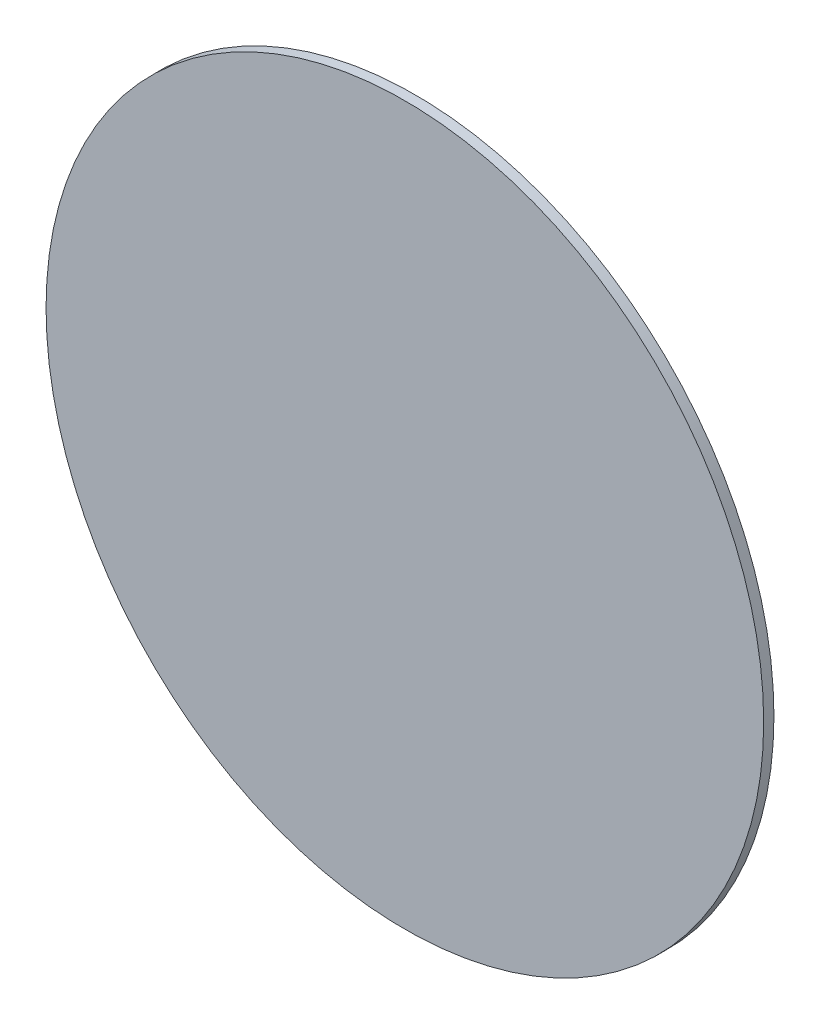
from build123d import *

# Parameters (mm, degrees)
ESQUISSE1_R        = 17.5
BOSS_EXTRU_1_DEPTH = 0.5


with BuildPart() as part:
    # Esquisse1 → Boss.-Extru.1 (new body)
    with BuildSketch(Plane.XY):
        Circle(ESQUISSE1_R)
    extrude(amount=BOSS_EXTRU_1_DEPTH)


solid = part.part
